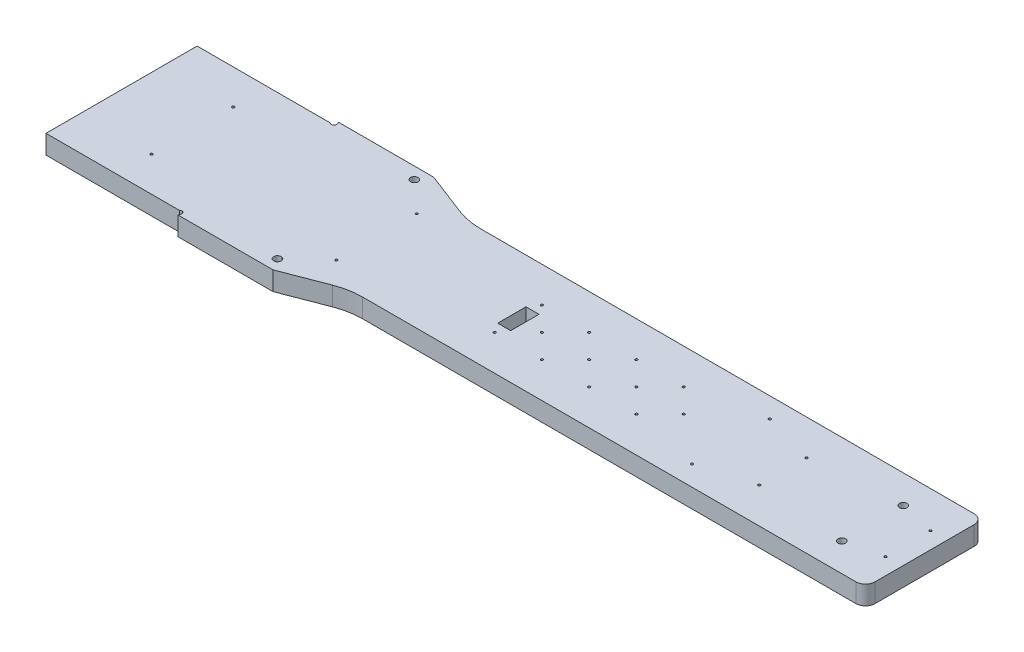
from build123d import *

# Parameters (mm, degrees)
ESQUISSE1_R             = 0.5
ESQUISSE1_R_2           = 1.6
BOSS_EXTRU_1_DEPTH      = 8
ESQUISSE4_R             = 0.5
ESQUISSE4_W             = 5.5
ESQUISSE4_H             = 12
ENL_V_MAT_EXTRU_2_DEPTH = 8
ESQUISSE6_R             = 0.5
ENL_V_MAT_EXTRU_4_DEPTH = 8
ENL_V_MAT_EXTRU_5_DEPTH = 6


with BuildPart() as part:
    # Esquisse1 → Boss.-Extru.1 (new body)
    with BuildSketch(Plane(origin=(0, 0, 0), x_dir=(1, 0, 0), z_dir=(0, 1, 0))):
        with BuildLine():
            Line((127.081213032, -25), (336, -25))
            ThreePointArc((336, -25), (338.828427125, -23.828427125), (340, -21))
            Line((340, -21), (340, 21))
            ThreePointArc((340, 21), (338.828427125, 23.828427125), (336, 25))
            Line((336, 25), (127.081213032, 25))
            ThreePointArc((127.081213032, 25), (121.59785971, 25.505376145), (116.299250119, 27.004477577))
            Line((116.299250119, 27.004477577), (98.135275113, 34))
            Line((98.135275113, 34), (58, 34))
            Line((58, 34), (58, 33.555634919))
            ThreePointArc((58, 33.555634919), (58, 32), (56.444365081, 32))
            Line((56.444365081, 32), (0, 32))
            Line((0, 32), (0, -32))
            Line((0, -32), (56.444365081, -32))
            ThreePointArc((56.444365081, -32), (58, -32), (58, -33.555634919))
            Line((58, -33.555634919), (58, -34))
            Line((58, -34), (98.135275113, -34))
            Line((98.135275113, -34), (116.299250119, -27.004477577))
            ThreePointArc((116.299250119, -27.004477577), (121.59785971, -25.505376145), (127.081213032, -25))
        make_face()
        with Locations(Location((30, -17.3, 0), (0, 0, 270))):
            Circle(ESQUISSE1_R, mode=Mode.SUBTRACT)
        with Locations(Location((30, 17.3, 0), (0, 0, 90))):
            Circle(ESQUISSE1_R, mode=Mode.SUBTRACT)
        with Locations(Location((333, -9.5, 0), (0, 0, 90))):
            Circle(ESQUISSE1_R, mode=Mode.SUBTRACT)
        with Locations(Location((108, -17, 0), (0, 0, 270))):
            Circle(ESQUISSE1_R, mode=Mode.SUBTRACT)
        with Locations(Location((108, 17, 0), (0, 0, 90))):
            Circle(ESQUISSE1_R, mode=Mode.SUBTRACT)
        with Locations(Location((280, -10, 0), (0, 0, 270))):
            Circle(ESQUISSE1_R, mode=Mode.SUBTRACT)
        with Locations(Location((333, 9.5, 0), (0, 0, 270))):
            Circle(ESQUISSE1_R, mode=Mode.SUBTRACT)
        with Locations(Location((280, 10, 0), (0, 0, 270))):
            Circle(ESQUISSE1_R, mode=Mode.SUBTRACT)
        with Locations(Location((95, -29, 0), (0, 0, 270))):
            Circle(ESQUISSE1_R_2, mode=Mode.SUBTRACT)
        with Locations(Location((95, 29, 0), (0, 0, 90))):
            Circle(ESQUISSE1_R_2, mode=Mode.SUBTRACT)
        with Locations(Location((318, 13, 0), (0, 0, 270))):
            Circle(ESQUISSE1_R_2, mode=Mode.SUBTRACT)
        with Locations(Location((318, -13, 0), (0, 0, 90))):
            Circle(ESQUISSE1_R_2, mode=Mode.SUBTRACT)
    extrude(amount=BOSS_EXTRU_1_DEPTH)

    # Esquisse4 → Enl_v. mat.-Extru.2 (cut)
    with BuildSketch(Plane.XZ):
        with Locations(Location((238, 0, 0), (0, 0, 270))):
            Circle(ESQUISSE4_R)
        with Locations(Location((228, 10, 0), (0, 0, 270))):
            Circle(ESQUISSE4_R)
        with Locations(Location((228, -10, 0), (0, 0, 90))):
            Circle(ESQUISSE4_R)
        with Locations(Location((208, -10, 0), (0, 0, 90))):
            Circle(ESQUISSE4_R)
        with Locations(Location((218, 0, 0), (0, 0, 270))):
            Circle(ESQUISSE4_R)
        with Locations(Location((208, 10, 0), (0, 0, 270))):
            Circle(ESQUISSE4_R)
        with Locations(Location((188, -10, 0), (0, 0, 90))):
            Circle(ESQUISSE4_R)
        with Locations(Location((198, 0, 0), (0, 0, 270))):
            Circle(ESQUISSE4_R)
        with Locations(Location((188, 10, 0), (0, 0, 270))):
            Circle(ESQUISSE4_R)
        with Locations(Location((168, -10, 0), (0, 0, 90))):
            Circle(ESQUISSE4_R)
        with Locations(Location((178, 0, 0), (0, 0, 270))):
            Circle(ESQUISSE4_R)
        with Locations(Location((168, 10, 0), (0, 0, 270))):
            Circle(ESQUISSE4_R)
        with Locations((168, 0)):
            Rectangle(ESQUISSE4_W, ESQUISSE4_H)
    extrude(amount=-ENL_V_MAT_EXTRU_2_DEPTH, mode=Mode.SUBTRACT)

    # Esquisse6 → Enl_v. mat.-Extru.4 (cut)
    with BuildSketch(Plane.XZ):
        with Locations(Location((258, 16.5, 0), (0, 0, 270))):
            Circle(ESQUISSE6_R)
        with Locations(Location((258, -16.5, 0), (0, 0, 90))):
            Circle(ESQUISSE6_R)
    extrude(amount=-ENL_V_MAT_EXTRU_4_DEPTH, mode=Mode.SUBTRACT)

    # Esquisse8 → Enl_v. mat.-Extru.5 (cut)
    with BuildSketch(Plane.XZ):
        with BuildLine():
            Line((310.3, -2.28035085), (310.3, -10.3))
            Line((310.3, -10.3), (282.28035085, -10.3))
            ThreePointArc((282.28035085, -10.3), (280, -12.3), (277.71964915, -10.3))
            Line((277.71964915, -10.3), (269.7, -10.3))
            Line((269.7, -10.3), (269.7, 10.3))
            Line((269.7, 10.3), (277.71964915, 10.3))
            ThreePointArc((277.71964915, 10.3), (280, 12.3), (282.28035085, 10.3))
            Line((282.28035085, 10.3), (310.3, 10.3))
            Line((310.3, 10.3), (310.3, 2.28035085))
            ThreePointArc((310.3, 2.28035085), (312.3, 0), (310.3, -2.28035085))
        make_face()
    extrude(amount=-ENL_V_MAT_EXTRU_5_DEPTH, mode=Mode.SUBTRACT)


solid = part.part
